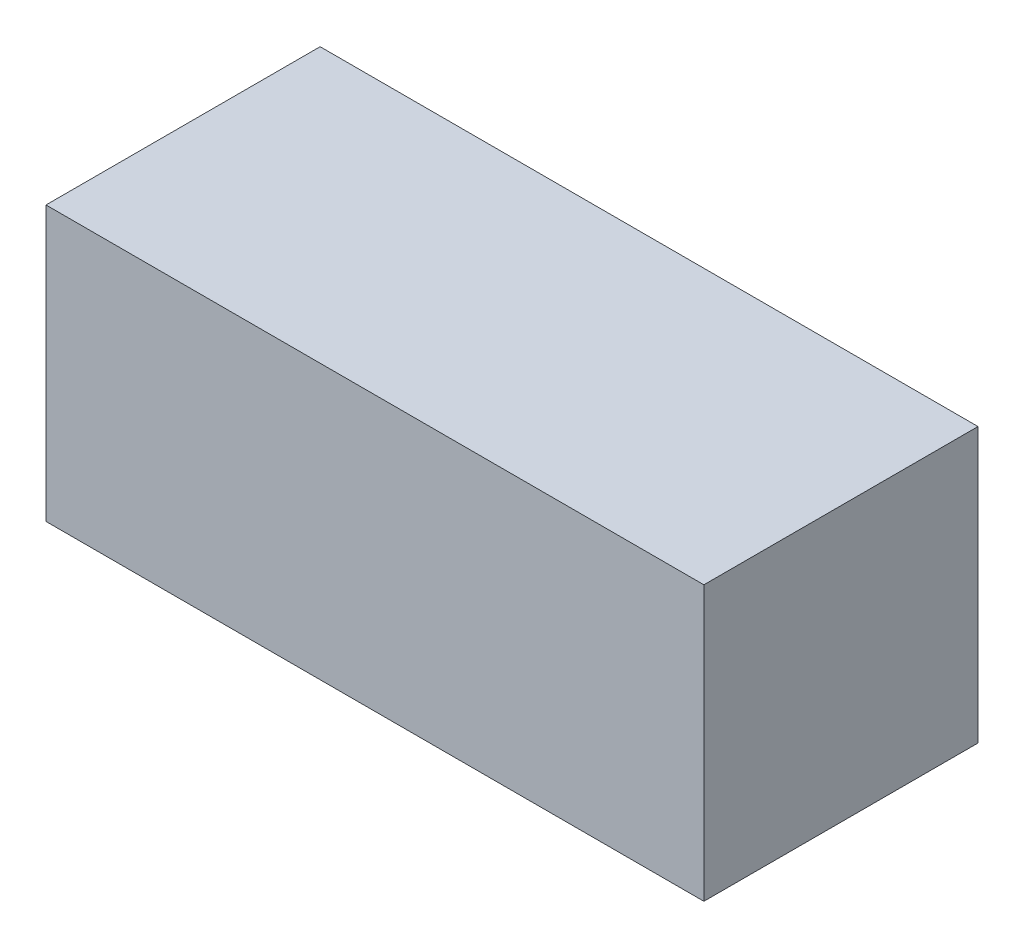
from build123d import *

# Parameters (mm, degrees)
SKETCH1_W           = 4.8
SKETCH1_H           = 2
BOSS_EXTRUDE1_DEPTH = 2


with BuildPart() as part:
    # Sketch1 → Boss-Extrude1 (new body)
    with BuildSketch(Plane.XY):
        with Locations((-1.104761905, 0.861904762)):
            Rectangle(SKETCH1_W, SKETCH1_H)
    extrude(amount=BOSS_EXTRUDE1_DEPTH)


solid = part.part
